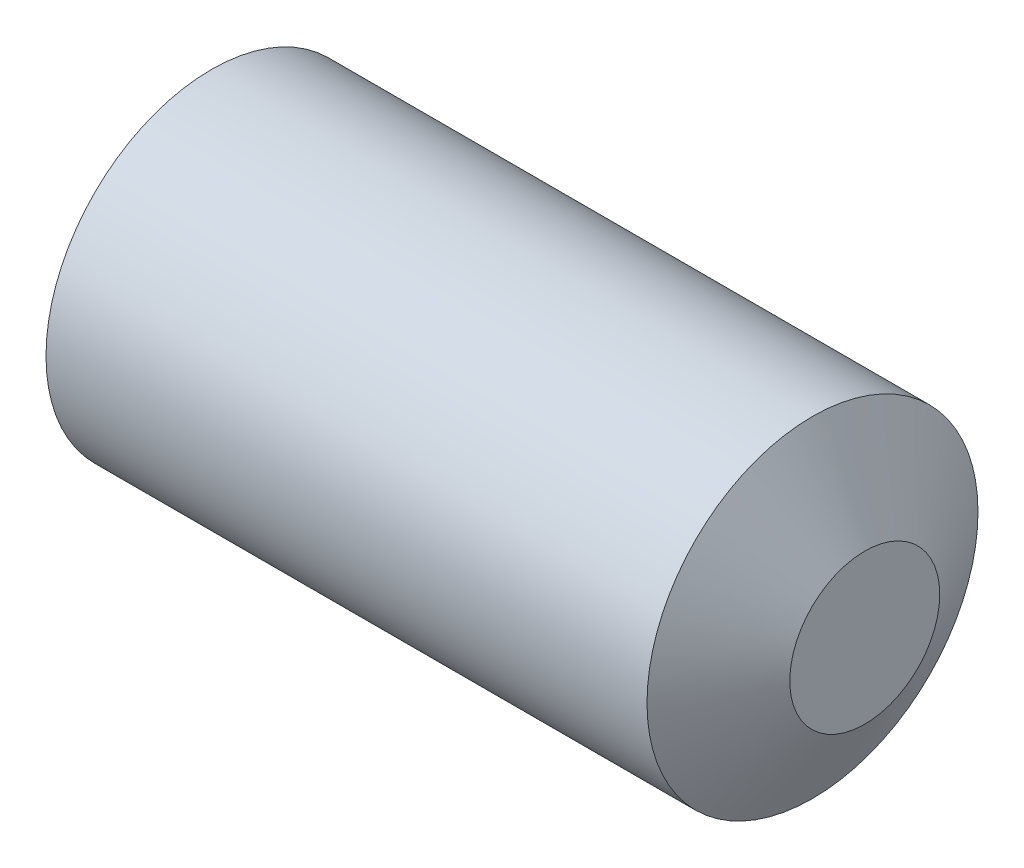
from build123d import *

# Parameters (mm, degrees)
CUT_EXTRUDE1_DEPTH = 3.81


with BuildPart() as part:
    # Sketch1 → Revolve1 (revolve)
    with BuildSketch(Plane(origin=(0, 0, 0), x_dir=(1, 0, 0), z_dir=(0, 1, 0))):
        Polygon((0, 0), (0, 1.093177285), (-0.762, 2.413), (-9.525, 2.413), (-9.525, 0), align=None)
    revolve(axis=Axis((0, 0, 0), (-1, 0, 0)))

    # Sketch2 → Cut-Extrude1 (cut)
    with BuildSketch(Plane.ZY.offset(9.525)):
        Polygon((0, 1.374815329), (1.190625, 0.687407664), (1.190625, -0.687407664), (0, -1.374815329), (-1.190625, -0.687407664), (-1.190625, 0.687407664), align=None)
    extrude(amount=-CUT_EXTRUDE1_DEPTH, mode=Mode.SUBTRACT)


solid = part.part
